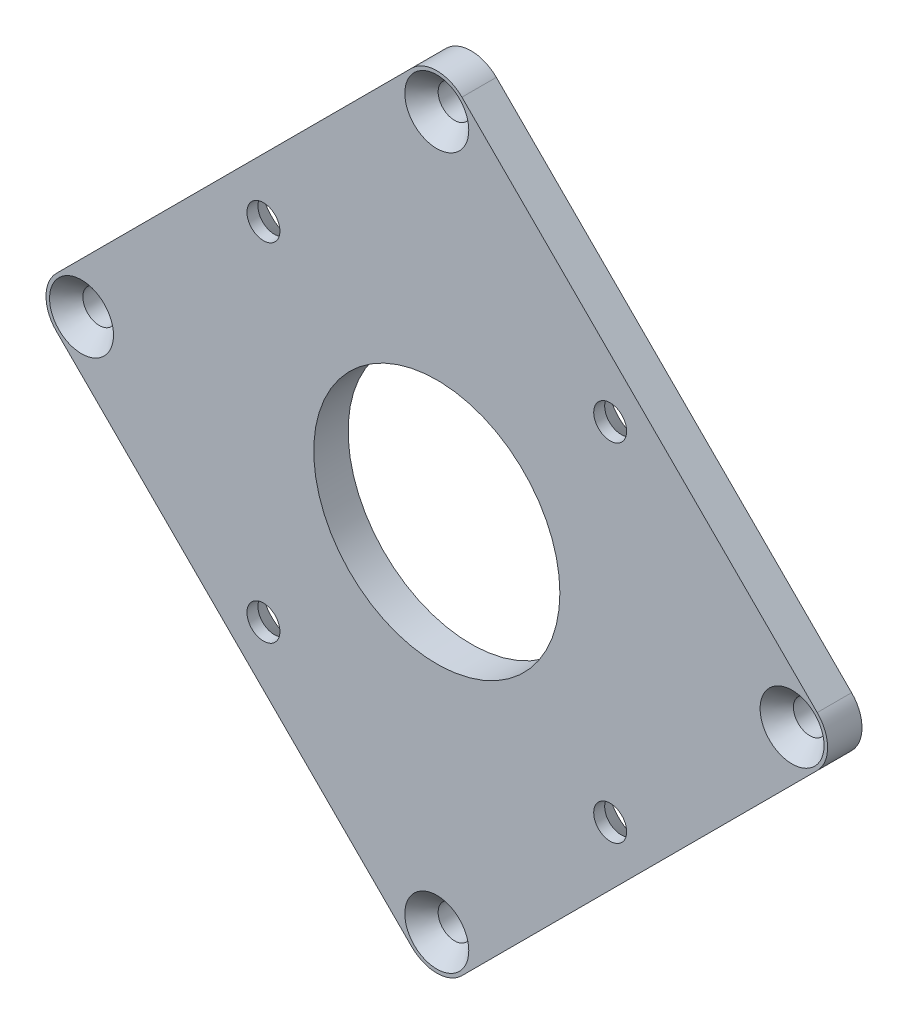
from build123d import *

# Parameters (mm, degrees)
SKETCH1_R                                     = 10.9982
BOSS_EXTRUDE1_DEPTH                           = 3.0734
CSK_FOR_4_FLAT_HEAD_MACHINE_SCREW1_AT_2_COUNT = 2
CSK_FOR_4_FLAT_HEAD_MACHINE_SCREW1_AT_2_PITCH = 30.988
CSK_FOR_4_FLAT_HEAD_MACHINE_SCREW1_AT_3_COUNT = 2
CSK_FOR_4_FLAT_HEAD_MACHINE_SCREW1_AT_3_PITCH = 43.823649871
CSK_FOR_4_FLAT_HEAD_MACHINE_SCREW1_AT_4_COUNT = 2
CSK_FOR_4_FLAT_HEAD_MACHINE_SCREW1_AT_4_PITCH = 30.988
CSK_FOR_4_FLAT_HEAD_MACHINE_SCREW2_AT_2_COUNT = 2
CSK_FOR_4_FLAT_HEAD_MACHINE_SCREW2_AT_2_PITCH = 44.901280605
CSK_FOR_4_FLAT_HEAD_MACHINE_SCREW2_AT_3_COUNT = 2
CSK_FOR_4_FLAT_HEAD_MACHINE_SCREW2_AT_3_PITCH = 63.5
CSK_FOR_4_FLAT_HEAD_MACHINE_SCREW2_AT_4_COUNT = 2
CSK_FOR_4_FLAT_HEAD_MACHINE_SCREW2_AT_4_PITCH = 44.901280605


with BuildPart() as part:
    # Sketch1 → Boss-Extrude1 (new body)
    with BuildSketch(Plane.XY):
        with BuildLine():
            Line((-2.24506403, 33.99506403), (-33.99506403, 2.24506403))
            ThreePointArc((-33.99506403, 2.24506403), (-34.925, 0), (-33.99506403, -2.24506403))
            Line((-33.99506403, -2.24506403), (-2.24506403, -33.99506403))
            ThreePointArc((-2.24506403, -33.99506403), (0, -34.925), (2.24506403, -33.99506403))
            Line((2.24506403, -33.99506403), (33.99506403, -2.24506403))
            ThreePointArc((33.99506403, -2.24506403), (34.925, 0), (33.99506403, 2.24506403))
            Line((33.99506403, 2.24506403), (2.24506403, 33.99506403))
            ThreePointArc((2.24506403, 33.99506403), (0, 34.925), (-2.24506403, 33.99506403))
        make_face()
        Circle(SKETCH1_R, mode=Mode.SUBTRACT)
    extrude(amount=BOSS_EXTRUDE1_DEPTH)

    # Sketch2 → CSK for _4 Flat Head Machine Screw1 (revolve, cut)
    with BuildSketch(Plane(origin=(-15.494, -15.494, 0), x_dir=(0, 1, 0), z_dir=(1, 0, 0))):
        Polygon((0, 0), (0, 3.0734), (1.4732, 3.0734), (1.4732, 2.092456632), (3.2921448, 0), align=None)
    csk_for_4_flat_head_machine_screw1 = revolve(axis=Axis((-15.494, -15.494, -6.35), (0, 0, 1)), mode=Mode.SUBTRACT)

    # CSK for _4 Flat Head Machine Screw1 at 2: CSK for _4 Flat Head Machine Screw1 ×2
    with Locations(*[(i * CSK_FOR_4_FLAT_HEAD_MACHINE_SCREW1_AT_2_PITCH, 0, 0) for i in range(1, CSK_FOR_4_FLAT_HEAD_MACHINE_SCREW1_AT_2_COUNT)]):
        add(csk_for_4_flat_head_machine_screw1, mode=Mode.SUBTRACT)

    # CSK for _4 Flat Head Machine Screw1 at 3: CSK for _4 Flat Head Machine Screw1 ×2
    with Locations(*[Vector(0.7071067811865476, 0.7071067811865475, 0) * (i * CSK_FOR_4_FLAT_HEAD_MACHINE_SCREW1_AT_3_PITCH) for i in range(1, CSK_FOR_4_FLAT_HEAD_MACHINE_SCREW1_AT_3_COUNT)]):
        add(csk_for_4_flat_head_machine_screw1, mode=Mode.SUBTRACT)

    # CSK for _4 Flat Head Machine Screw1 at 4: CSK for _4 Flat Head Machine Screw1 ×2
    with Locations(*[(0, i * CSK_FOR_4_FLAT_HEAD_MACHINE_SCREW1_AT_4_PITCH, 0) for i in range(1, CSK_FOR_4_FLAT_HEAD_MACHINE_SCREW1_AT_4_COUNT)]):
        add(csk_for_4_flat_head_machine_screw1, mode=Mode.SUBTRACT)

    # Sketch4 → CSK for _4 Flat Head Machine Screw2 (revolve, cut)
    with BuildSketch(Plane(origin=(0, -31.75, 3.0734), x_dir=(0, -1, 0), z_dir=(1, 0, 0))):
        Polygon((0, 0), (0, 3.0734), (1.4732, 3.0734), (1.4732, 1.592456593), (2.857501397, 0), align=None)
    csk_for_4_flat_head_machine_screw2 = revolve(axis=Axis((0, -31.75, 9.4234), (0, 0, -1)), mode=Mode.SUBTRACT)

    # CSK for _4 Flat Head Machine Screw2 at 2: CSK for _4 Flat Head Machine Screw2 ×2
    with Locations(*[Vector(-0.7071067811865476, 0.7071067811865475, 0) * (i * CSK_FOR_4_FLAT_HEAD_MACHINE_SCREW2_AT_2_PITCH) for i in range(1, CSK_FOR_4_FLAT_HEAD_MACHINE_SCREW2_AT_2_COUNT)]):
        add(csk_for_4_flat_head_machine_screw2, mode=Mode.SUBTRACT)

    # CSK for _4 Flat Head Machine Screw2 at 3: CSK for _4 Flat Head Machine Screw2 ×2
    with Locations(*[(0, i * CSK_FOR_4_FLAT_HEAD_MACHINE_SCREW2_AT_3_PITCH, 0) for i in range(1, CSK_FOR_4_FLAT_HEAD_MACHINE_SCREW2_AT_3_COUNT)]):
        add(csk_for_4_flat_head_machine_screw2, mode=Mode.SUBTRACT)

    # CSK for _4 Flat Head Machine Screw2 at 4: CSK for _4 Flat Head Machine Screw2 ×2
    with Locations(*[Vector(0.7071067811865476, 0.7071067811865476, 0) * (i * CSK_FOR_4_FLAT_HEAD_MACHINE_SCREW2_AT_4_PITCH) for i in range(1, CSK_FOR_4_FLAT_HEAD_MACHINE_SCREW2_AT_4_COUNT)]):
        add(csk_for_4_flat_head_machine_screw2, mode=Mode.SUBTRACT)


solid = part.part
